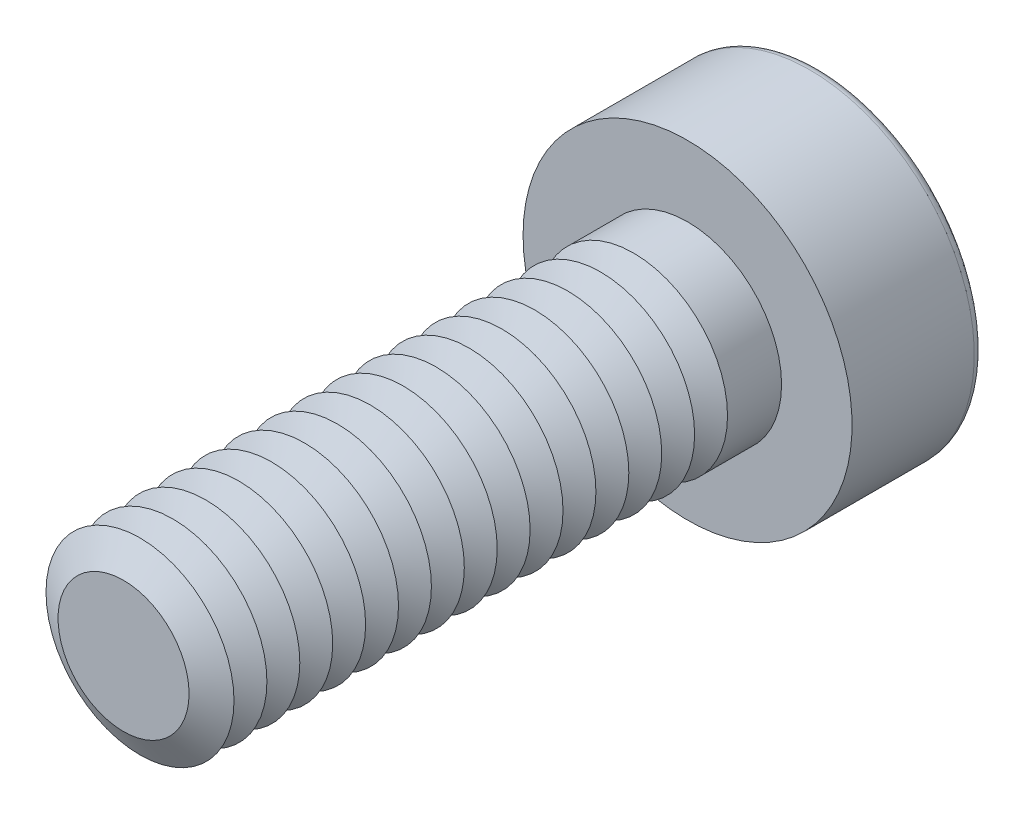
from build123d import *

# Parameters (mm, degrees)
SKETCH1_R           = 2
BOSS_EXTRUDE1_DEPTH = 12
SKETCH2_R           = 3.5
BOSS_EXTRUDE2_DEPTH = 2.8
CUT_EXTRUDE1_DEPTH  = 1.875
FILLET1_R           = 0.2
LPATTERN1_COUNT     = 16
LPATTERN1_PITCH     = 0.7


with BuildPart() as part:
    # Sketch1 → Boss-Extrude1 (new body)
    with BuildSketch(Plane.XY):
        Circle(SKETCH1_R)
    extrude(amount=BOSS_EXTRUDE1_DEPTH)

    # Sketch2 → Boss-Extrude2 (add)
    with BuildSketch(Plane(origin=(0, 0, 0), x_dir=(-1, 0, 0), z_dir=(0, 0, -1))):
        Circle(SKETCH2_R)
    extrude(amount=BOSS_EXTRUDE2_DEPTH)

    # Sketch3 → Cut-Extrude1 (cut)
    with BuildSketch(Plane(origin=(0, 0, -2.8), x_dir=(-1, 0, 0), z_dir=(0, 0, -1))):
        Polygon((-0.721687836, 1.25), (-1.443375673, 0), (-0.721687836, -1.25), (0.721687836, -1.25), (1.443375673, 0), (0.721687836, 1.25), align=None)
    extrude(amount=-CUT_EXTRUDE1_DEPTH, mode=Mode.SUBTRACT)

    # Fillet1
    fillet1_edges = [part.edges().sort_by_distance(p)[0] for p in [
        (3.5, 0, -2.8),
    ]]
    fillet(fillet1_edges, radius=FILLET1_R)

    # Cut-Extrude2 cone 1 section (on through the dimple's axis) → Cut-Extrude2 (revolve, cut)
    with BuildSketch(Plane(origin=(0, 0, -0.925), x_dir=(0, 1, 0), z_dir=(1, 0, 0))):
        Polygon((0, 0), (1.25, 0), (0, 0.721687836), align=None)
    revolve(axis=Axis((0, 0, -0.925), (0, 0, 1)), mode=Mode.SUBTRACT)

    # Cut-Extrude3 cone 1 section (on through the dimple's axis) → Cut-Extrude3 (revolve, cut)
    with BuildSketch(Plane(origin=(0, 0, -2.8), x_dir=(0, 1, 0), z_dir=(1, 0, 0))):
        Polygon((0, 0), (1.443375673, 0), (0, 0.386751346), align=None)
    revolve(axis=Axis((0, 0, -2.8), (0, 0, 1)), mode=Mode.SUBTRACT)

    # Sketch7 → Cut-Revolve1 (revolve, cut)
    with BuildSketch(Plane(origin=(0, 0, 0), x_dir=(0, 0, -1), z_dir=(1, 0, 0)), mode=Mode.PRIVATE) as cut_revolve1_sk:
        Polygon((-12, 1.393782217), (-11.65, 2), (-12.35, 2), align=None)
    cut_revolve1 = revolve(cut_revolve1_sk.sketch.rotate(Axis((0, 0, 12), (0, 0, -1)), 90), axis=Axis((0, 0, 12), (0, 0, -1)), mode=Mode.SUBTRACT)

    # LPattern1: Cut-Revolve1 ×16
    with Locations(*[(0, 0, -i * LPATTERN1_PITCH) for i in range(1, LPATTERN1_COUNT)]):
        add(cut_revolve1, mode=Mode.SUBTRACT)


solid = part.part
